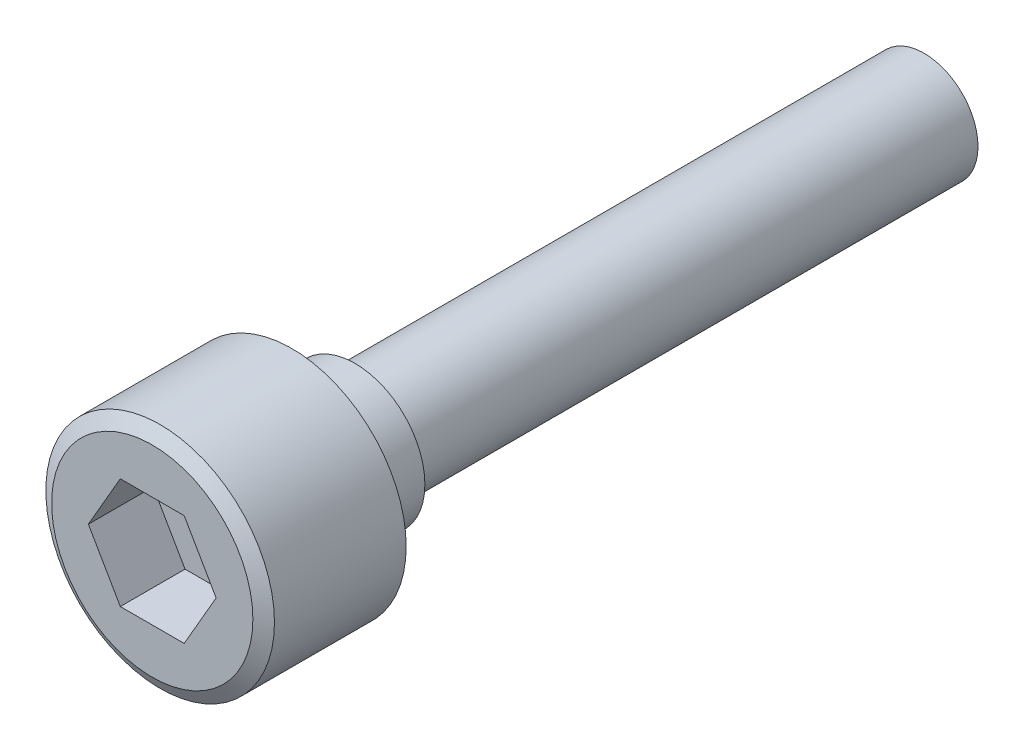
ISO-10303-21;
HEADER;
FILE_DESCRIPTION(('STEP AP214'),'2;1');
FILE_NAME('part.step','',(''),(''),'','','');
FILE_SCHEMA(('AUTOMOTIVE_DESIGN { 1 0 10303 214 1 1 1 1 }'));
ENDSEC;
DATA;
#1=APPLICATION_CONTEXT('core data for automotive mechanical design processes');
#2=APPLICATION_PROTOCOL_DEFINITION('international standard','automotive_design',2000,#1);
#3=PRODUCT_CONTEXT('',#1,'mechanical');
#4=PRODUCT('Part','Part','',(#3));
#5=PRODUCT_RELATED_PRODUCT_CATEGORY('part','',(#4));
#6=PRODUCT_DEFINITION_FORMATION('','',#4);
#7=PRODUCT_DEFINITION_CONTEXT('part definition',#1,'design');
#8=PRODUCT_DEFINITION('design','',#6,#7);
#9=PRODUCT_DEFINITION_SHAPE('','',#8);
#10=(LENGTH_UNIT() NAMED_UNIT(*) SI_UNIT(.MILLI.,.METRE.));
#11=(NAMED_UNIT(*) PLANE_ANGLE_UNIT() SI_UNIT($,.RADIAN.));
#12=(NAMED_UNIT(*) SI_UNIT($,.STERADIAN.) SOLID_ANGLE_UNIT());
#13=UNCERTAINTY_MEASURE_WITH_UNIT(LENGTH_MEASURE(1.E-05),#10,'distance_accuracy_value','');
#14=(GEOMETRIC_REPRESENTATION_CONTEXT(3) GLOBAL_UNCERTAINTY_ASSIGNED_CONTEXT((#13)) GLOBAL_UNIT_ASSIGNED_CONTEXT((#10,
#11,#12)) REPRESENTATION_CONTEXT('',''));
#15=CARTESIAN_POINT('',(0.,0.,0.));
#16=DIRECTION('',(0.,0.,1.));
#17=DIRECTION('',(1.,0.,0.));
#18=AXIS2_PLACEMENT_3D('',#15,#16,#17);
#19=CARTESIAN_POINT('',(0.,1.38906250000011,0.));
#20=DIRECTION('',(0.,0.,1.));
#21=DIRECTION('',(1.,0.,0.));
#22=AXIS2_PLACEMENT_3D('',#19,#20,#21);
#23=PLANE('',#22);
#24=CARTESIAN_POINT('',(0.,0.,0.));
#25=DIRECTION('',(0.,0.,1.));
#26=DIRECTION('',(1.,0.,0.));
#27=AXIS2_PLACEMENT_3D('',#24,#25,#26);
#28=CIRCLE('',#27,2.52649616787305);
#29=CARTESIAN_POINT('',(2.52649616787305,0.,0.));
#30=VERTEX_POINT('',#29);
#31=EDGE_CURVE('E130',#30,#30,#28,.T.);
#32=ORIENTED_EDGE('',*,*,#31,.T.);
#33=EDGE_LOOP('',(#32));
#34=FACE_BOUND('',#33,.T.);
#35=DIRECTION('',(1.,0.,0.));
#36=VECTOR('',#35,1.);
#37=CARTESIAN_POINT('',(4.71844785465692E-13,-1.38906249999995,0.));
#38=LINE('',#37,#36);
#39=CARTESIAN_POINT('',(-0.80197560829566,-1.38906249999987,0.));
#40=VERTEX_POINT('',#39);
#41=CARTESIAN_POINT('',(0.801975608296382,-1.38906249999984,0.));
#42=VERTEX_POINT('',#41);
#43=EDGE_CURVE('E169',#40,#42,#38,.T.);
#44=ORIENTED_EDGE('',*,*,#43,.F.);
#45=DIRECTION('',(-0.499999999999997,0.866025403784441,0.));
#46=VECTOR('',#45,1.);
#47=CARTESIAN_POINT('',(-1.8044451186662,0.347265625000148,0.));
#48=LINE('',#47,#46);
#49=CARTESIAN_POINT('',(-1.60395121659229,1.38777878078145E-13,0.));
#50=VERTEX_POINT('',#49);
#51=EDGE_CURVE('E11',#40,#50,#48,.T.);
#52=ORIENTED_EDGE('',*,*,#51,.T.);
#53=DIRECTION('',(-0.499999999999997,-0.866025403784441,0.));
#54=VECTOR('',#53,1.);
#55=CARTESIAN_POINT('',(-0.60148170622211,1.73632812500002,0.));
#56=LINE('',#55,#54);
#57=CARTESIAN_POINT('',(-0.801975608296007,1.38906250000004,0.));
#58=VERTEX_POINT('',#57);
#59=EDGE_CURVE('E52',#58,#50,#56,.T.);
#60=ORIENTED_EDGE('',*,*,#59,.F.);
#61=DIRECTION('',(1.,0.,0.));
#62=VECTOR('',#61,1.);
#63=CARTESIAN_POINT('',(0.,1.38906250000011,0.));
#64=LINE('',#63,#62);
#65=CARTESIAN_POINT('',(0.801975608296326,1.38906250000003,0.));
#66=VERTEX_POINT('',#65);
#67=EDGE_CURVE('E110',#58,#66,#64,.T.);
#68=ORIENTED_EDGE('',*,*,#67,.T.);
#69=DIRECTION('',(0.499999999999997,-0.866025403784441,0.));
#70=VECTOR('',#69,1.);
#71=CARTESIAN_POINT('',(0.601481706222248,1.7363281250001,0.));
#72=LINE('',#71,#70);
#73=CARTESIAN_POINT('',(1.60395121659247,0.,0.));
#74=VERTEX_POINT('',#73);
#75=EDGE_CURVE('E163',#66,#74,#72,.T.);
#76=ORIENTED_EDGE('',*,*,#75,.T.);
#77=DIRECTION('',(0.499999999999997,0.866025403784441,0.));
#78=VECTOR('',#77,1.);
#79=CARTESIAN_POINT('',(1.80444511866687,0.347265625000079,0.));
#80=LINE('',#79,#78);
#81=EDGE_CURVE('E159',#42,#74,#80,.T.);
#82=ORIENTED_EDGE('',*,*,#81,.F.);
#83=EDGE_LOOP('',(#44,#52,#60,#68,#76,#82));
#84=FACE_BOUND('',#83,.T.);
#85=ADVANCED_FACE('F42',(#34,#84),#23,.T.);
#86=CARTESIAN_POINT('',(0.,0.,0.));
#87=DIRECTION('',(0.,0.,-1.));
#88=DIRECTION('',(-1.,0.,0.));
#89=AXIS2_PLACEMENT_3D('',#86,#87,#88);
#90=CONICAL_SURFACE('',#89,2.52649616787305,1.0471975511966);
#91=CARTESIAN_POINT('',(0.,0.,-0.198437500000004));
#92=DIRECTION('',(0.,0.,1.));
#93=DIRECTION('',(1.,0.,0.));
#94=AXIS2_PLACEMENT_3D('',#91,#92,#93);
#95=CIRCLE('',#94,2.8702);
#96=CARTESIAN_POINT('',(2.8702,0.,-0.198437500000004));
#97=VERTEX_POINT('',#96);
#98=EDGE_CURVE('E155',#97,#97,#95,.T.);
#99=ORIENTED_EDGE('',*,*,#98,.T.);
#100=EDGE_LOOP('',(#99));
#101=FACE_BOUND('',#100,.T.);
#102=ORIENTED_EDGE('',*,*,#31,.F.);
#103=EDGE_LOOP('',(#102));
#104=FACE_BOUND('',#103,.T.);
#105=ADVANCED_FACE('F44',(#101,#104),#90,.T.);
#106=CARTESIAN_POINT('',(0.,0.,0.));
#107=DIRECTION('',(0.,0.,1.));
#108=DIRECTION('',(1.,0.,0.));
#109=AXIS2_PLACEMENT_3D('',#106,#107,#108);
#110=CYLINDRICAL_SURFACE('',#109,2.8702);
#111=CARTESIAN_POINT('',(0.,0.,-3.5052));
#112=DIRECTION('',(0.,0.,1.));
#113=DIRECTION('',(1.,0.,0.));
#114=AXIS2_PLACEMENT_3D('',#111,#112,#113);
#115=CIRCLE('',#114,2.8702);
#116=CARTESIAN_POINT('',(2.8702,0.,-3.5052));
#117=VERTEX_POINT('',#116);
#118=EDGE_CURVE('E151',#117,#117,#115,.T.);
#119=ORIENTED_EDGE('',*,*,#118,.T.);
#120=EDGE_LOOP('',(#119));
#121=FACE_BOUND('',#120,.T.);
#122=ORIENTED_EDGE('',*,*,#98,.F.);
#123=EDGE_LOOP('',(#122));
#124=FACE_BOUND('',#123,.T.);
#125=ADVANCED_FACE('F227',(#121,#124),#110,.T.);
#126=CARTESIAN_POINT('',(3.60822483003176E-13,2.8702000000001,-3.5052));
#127=DIRECTION('',(0.,0.,-1.));
#128=DIRECTION('',(-1.,0.,0.));
#129=AXIS2_PLACEMENT_3D('',#126,#127,#128);
#130=PLANE('',#129);
#131=CARTESIAN_POINT('',(0.,0.,-3.5052));
#132=DIRECTION('',(0.,0.,1.));
#133=DIRECTION('',(1.,0.,0.));
#134=AXIS2_PLACEMENT_3D('',#131,#132,#133);
#135=CIRCLE('',#134,1.7526);
#136=CARTESIAN_POINT('',(1.7526,0.,-3.5052));
#137=VERTEX_POINT('',#136);
#138=EDGE_CURVE('E147',#137,#137,#135,.T.);
#139=ORIENTED_EDGE('',*,*,#138,.T.);
#140=EDGE_LOOP('',(#139));
#141=FACE_BOUND('',#140,.T.);
#142=ORIENTED_EDGE('',*,*,#118,.F.);
#143=EDGE_LOOP('',(#142));
#144=FACE_BOUND('',#143,.T.);
#145=ADVANCED_FACE('F247',(#141,#144),#130,.T.);
#146=CARTESIAN_POINT('',(0.,0.,0.));
#147=DIRECTION('',(0.,0.,1.));
#148=DIRECTION('',(1.,0.,0.));
#149=AXIS2_PLACEMENT_3D('',#146,#147,#148);
#150=CYLINDRICAL_SURFACE('',#149,1.7526);
#151=CARTESIAN_POINT('',(0.,0.,-5.09269999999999));
#152=DIRECTION('',(0.,0.,1.));
#153=DIRECTION('',(1.,0.,0.));
#154=AXIS2_PLACEMENT_3D('',#151,#152,#153);
#155=CIRCLE('',#154,1.7526);
#156=CARTESIAN_POINT('',(1.7526,0.,-5.09269999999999));
#157=VERTEX_POINT('',#156);
#158=EDGE_CURVE('E143',#157,#157,#155,.T.);
#159=ORIENTED_EDGE('',*,*,#158,.T.);
#160=EDGE_LOOP('',(#159));
#161=FACE_BOUND('',#160,.T.);
#162=ORIENTED_EDGE('',*,*,#138,.F.);
#163=EDGE_LOOP('',(#162));
#164=FACE_BOUND('',#163,.T.);
#165=ADVANCED_FACE('F243',(#161,#164),#150,.T.);
#166=CARTESIAN_POINT('',(0.,1.75260000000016,-5.09269999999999));
#167=DIRECTION('',(0.,0.,-1.));
#168=DIRECTION('',(-1.,0.,0.));
#169=AXIS2_PLACEMENT_3D('',#166,#167,#168);
#170=PLANE('',#169);
#171=CARTESIAN_POINT('',(0.,0.,-5.09269999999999));
#172=DIRECTION('',(0.,0.,1.));
#173=DIRECTION('',(1.,0.,0.));
#174=AXIS2_PLACEMENT_3D('',#171,#172,#173);
#175=CIRCLE('',#174,1.35255);
#176=CARTESIAN_POINT('',(1.35255,0.,-5.09269999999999));
#177=VERTEX_POINT('',#176);
#178=EDGE_CURVE('E139',#177,#177,#175,.T.);
#179=ORIENTED_EDGE('',*,*,#178,.T.);
#180=EDGE_LOOP('',(#179));
#181=FACE_BOUND('',#180,.T.);
#182=ORIENTED_EDGE('',*,*,#158,.F.);
#183=EDGE_LOOP('',(#182));
#184=FACE_BOUND('',#183,.T.);
#185=ADVANCED_FACE('F239',(#181,#184),#170,.T.);
#186=CARTESIAN_POINT('',(0.,0.,0.));
#187=DIRECTION('',(0.,0.,1.));
#188=DIRECTION('',(1.,0.,0.));
#189=AXIS2_PLACEMENT_3D('',#186,#187,#188);
#190=CYLINDRICAL_SURFACE('',#189,1.35255);
#191=CARTESIAN_POINT('',(0.,0.,-19.3802));
#192=DIRECTION('',(0.,0.,1.));
#193=DIRECTION('',(1.,0.,0.));
#194=AXIS2_PLACEMENT_3D('',#191,#192,#193);
#195=CIRCLE('',#194,1.35255);
#196=CARTESIAN_POINT('',(1.35255,0.,-19.3802));
#197=VERTEX_POINT('',#196);
#198=EDGE_CURVE('E135',#197,#197,#195,.T.);
#199=ORIENTED_EDGE('',*,*,#198,.T.);
#200=EDGE_LOOP('',(#199));
#201=FACE_BOUND('',#200,.T.);
#202=ORIENTED_EDGE('',*,*,#178,.F.);
#203=EDGE_LOOP('',(#202));
#204=FACE_BOUND('',#203,.T.);
#205=ADVANCED_FACE('F235',(#201,#204),#190,.T.);
#206=CARTESIAN_POINT('',(1.38777878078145E-13,1.35255000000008,-19.3802));
#207=DIRECTION('',(0.,0.,-1.));
#208=DIRECTION('',(-1.,0.,0.));
#209=AXIS2_PLACEMENT_3D('',#206,#207,#208);
#210=PLANE('',#209);
#211=ORIENTED_EDGE('',*,*,#198,.F.);
#212=EDGE_LOOP('',(#211));
#213=FACE_BOUND('',#212,.T.);
#214=ADVANCED_FACE('F219',(#213),#210,.T.);
#215=CARTESIAN_POINT('',(-0.80197560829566,-1.38906249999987,-5.86925603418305));
#216=DIRECTION('',(0.,-1.,0.));
#217=DIRECTION('',(0.,0.,-1.));
#218=AXIS2_PLACEMENT_3D('',#215,#216,#217);
#219=PLANE('',#218);
#220=ORIENTED_EDGE('',*,*,#43,.T.);
#221=DIRECTION('',(0.,0.,1.));
#222=VECTOR('',#221,1.);
#223=CARTESIAN_POINT('',(0.801975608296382,-1.38906249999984,-5.86925603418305));
#224=LINE('',#223,#222);
#225=CARTESIAN_POINT('',(0.801975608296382,-1.38906249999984,-1.6256));
#226=VERTEX_POINT('',#225);
#227=EDGE_CURVE('E125',#226,#42,#224,.T.);
#228=ORIENTED_EDGE('',*,*,#227,.F.);
#229=DIRECTION('',(-1.,0.,0.));
#230=VECTOR('',#229,1.);
#231=CARTESIAN_POINT('',(-0.80197560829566,-1.38906249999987,-1.6256));
#232=LINE('',#231,#230);
#233=CARTESIAN_POINT('',(-0.80197560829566,-1.38906249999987,-1.6256));
#234=VERTEX_POINT('',#233);
#235=EDGE_CURVE('E131',#226,#234,#232,.T.);
#236=ORIENTED_EDGE('',*,*,#235,.T.);
#237=DIRECTION('',(0.,0.,1.));
#238=VECTOR('',#237,1.);
#239=CARTESIAN_POINT('',(-0.80197560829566,-1.38906249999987,-5.86925603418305));
#240=LINE('',#239,#238);
#241=EDGE_CURVE('E116',#234,#40,#240,.T.);
#242=ORIENTED_EDGE('',*,*,#241,.T.);
#243=EDGE_LOOP('',(#220,#228,#236,#242));
#244=FACE_BOUND('',#243,.T.);
#245=ADVANCED_FACE('F178',(#244),#219,.F.);
#246=CARTESIAN_POINT('',(-0.80197560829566,-1.38906249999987,-5.86925603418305));
#247=DIRECTION('',(0.866025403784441,0.499999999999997,0.));
#248=DIRECTION('',(-0.499999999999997,0.866025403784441,0.));
#249=AXIS2_PLACEMENT_3D('',#246,#247,#248);
#250=PLANE('',#249);
#251=ORIENTED_EDGE('',*,*,#51,.F.);
#252=ORIENTED_EDGE('',*,*,#241,.F.);
#253=DIRECTION('',(0.499999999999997,-0.866025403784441,0.));
#254=VECTOR('',#253,1.);
#255=CARTESIAN_POINT('',(-0.80197560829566,-1.38906249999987,-1.6256));
#256=LINE('',#255,#254);
#257=CARTESIAN_POINT('',(-1.60395121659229,1.38777878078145E-13,-1.6256));
#258=VERTEX_POINT('',#257);
#259=EDGE_CURVE('E95',#258,#234,#256,.T.);
#260=ORIENTED_EDGE('',*,*,#259,.F.);
#261=DIRECTION('',(0.,0.,1.));
#262=VECTOR('',#261,1.);
#263=CARTESIAN_POINT('',(-1.60395121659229,1.38777878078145E-13,-5.86925603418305));
#264=LINE('',#263,#262);
#265=EDGE_CURVE('E91',#258,#50,#264,.T.);
#266=ORIENTED_EDGE('',*,*,#265,.T.);
#267=EDGE_LOOP('',(#251,#252,#260,#266));
#268=FACE_BOUND('',#267,.T.);
#269=ADVANCED_FACE('F211',(#268),#250,.T.);
#270=CARTESIAN_POINT('',(-0.801975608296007,1.38906250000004,-5.86925603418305));
#271=DIRECTION('',(-0.866025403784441,0.499999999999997,0.));
#272=DIRECTION('',(-0.499999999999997,-0.866025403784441,0.));
#273=AXIS2_PLACEMENT_3D('',#270,#271,#272);
#274=PLANE('',#273);
#275=ORIENTED_EDGE('',*,*,#59,.T.);
#276=ORIENTED_EDGE('',*,*,#265,.F.);
#277=DIRECTION('',(0.499999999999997,0.866025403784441,0.));
#278=VECTOR('',#277,1.);
#279=CARTESIAN_POINT('',(-0.801975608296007,1.38906250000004,-1.6256));
#280=LINE('',#279,#278);
#281=CARTESIAN_POINT('',(-0.801975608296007,1.38906250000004,-1.6256));
#282=VERTEX_POINT('',#281);
#283=EDGE_CURVE('E83',#258,#282,#280,.T.);
#284=ORIENTED_EDGE('',*,*,#283,.T.);
#285=DIRECTION('',(0.,0.,1.));
#286=VECTOR('',#285,1.);
#287=CARTESIAN_POINT('',(-0.801975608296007,1.38906250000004,-5.86925603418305));
#288=LINE('',#287,#286);
#289=EDGE_CURVE('E89',#282,#58,#288,.T.);
#290=ORIENTED_EDGE('',*,*,#289,.T.);
#291=EDGE_LOOP('',(#275,#276,#284,#290));
#292=FACE_BOUND('',#291,.T.);
#293=ADVANCED_FACE('F86',(#292),#274,.F.);
#294=CARTESIAN_POINT('',(-0.801975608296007,1.38906250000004,-5.86925603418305));
#295=DIRECTION('',(0.,-1.,0.));
#296=DIRECTION('',(0.,0.,-1.));
#297=AXIS2_PLACEMENT_3D('',#294,#295,#296);
#298=PLANE('',#297);
#299=ORIENTED_EDGE('',*,*,#67,.F.);
#300=ORIENTED_EDGE('',*,*,#289,.F.);
#301=DIRECTION('',(-1.,0.,0.));
#302=VECTOR('',#301,1.);
#303=CARTESIAN_POINT('',(-0.801975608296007,1.38906250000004,-1.6256));
#304=LINE('',#303,#302);
#305=CARTESIAN_POINT('',(0.801975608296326,1.38906250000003,-1.6256));
#306=VERTEX_POINT('',#305);
#307=EDGE_CURVE('E96',#306,#282,#304,.T.);
#308=ORIENTED_EDGE('',*,*,#307,.F.);
#309=DIRECTION('',(0.,0.,1.));
#310=VECTOR('',#309,1.);
#311=CARTESIAN_POINT('',(0.801975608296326,1.38906250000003,-5.86925603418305));
#312=LINE('',#311,#310);
#313=EDGE_CURVE('E112',#306,#66,#312,.T.);
#314=ORIENTED_EDGE('',*,*,#313,.T.);
#315=EDGE_LOOP('',(#299,#300,#308,#314));
#316=FACE_BOUND('',#315,.T.);
#317=ADVANCED_FACE('F108',(#316),#298,.T.);
#318=CARTESIAN_POINT('',(0.801975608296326,1.38906250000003,-5.86925603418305));
#319=DIRECTION('',(-0.866025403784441,-0.499999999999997,0.));
#320=DIRECTION('',(0.499999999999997,-0.866025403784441,0.));
#321=AXIS2_PLACEMENT_3D('',#318,#319,#320);
#322=PLANE('',#321);
#323=ORIENTED_EDGE('',*,*,#75,.F.);
#324=ORIENTED_EDGE('',*,*,#313,.F.);
#325=DIRECTION('',(-0.499999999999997,0.866025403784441,0.));
#326=VECTOR('',#325,1.);
#327=CARTESIAN_POINT('',(0.801975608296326,1.38906250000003,-1.6256));
#328=LINE('',#327,#326);
#329=CARTESIAN_POINT('',(1.60395121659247,0.,-1.6256));
#330=VERTEX_POINT('',#329);
#331=EDGE_CURVE('E101',#330,#306,#328,.T.);
#332=ORIENTED_EDGE('',*,*,#331,.F.);
#333=DIRECTION('',(0.,0.,1.));
#334=VECTOR('',#333,1.);
#335=CARTESIAN_POINT('',(1.60395121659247,0.,-5.86925603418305));
#336=LINE('',#335,#334);
#337=EDGE_CURVE('E118',#330,#74,#336,.T.);
#338=ORIENTED_EDGE('',*,*,#337,.T.);
#339=EDGE_LOOP('',(#323,#324,#332,#338));
#340=FACE_BOUND('',#339,.T.);
#341=ADVANCED_FACE('F193',(#340),#322,.T.);
#342=CARTESIAN_POINT('',(0.801975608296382,-1.38906249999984,-5.86925603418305));
#343=DIRECTION('',(0.866025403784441,-0.499999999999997,0.));
#344=DIRECTION('',(0.499999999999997,0.866025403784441,0.));
#345=AXIS2_PLACEMENT_3D('',#342,#343,#344);
#346=PLANE('',#345);
#347=ORIENTED_EDGE('',*,*,#81,.T.);
#348=ORIENTED_EDGE('',*,*,#337,.F.);
#349=DIRECTION('',(-0.499999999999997,-0.866025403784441,0.));
#350=VECTOR('',#349,1.);
#351=CARTESIAN_POINT('',(0.801975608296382,-1.38906249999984,-1.6256));
#352=LINE('',#351,#350);
#353=EDGE_CURVE('E62',#330,#226,#352,.T.);
#354=ORIENTED_EDGE('',*,*,#353,.T.);
#355=ORIENTED_EDGE('',*,*,#227,.T.);
#356=EDGE_LOOP('',(#347,#348,#354,#355));
#357=FACE_BOUND('',#356,.T.);
#358=ADVANCED_FACE('F187',(#357),#346,.F.);
#359=CARTESIAN_POINT('',(0.,1.38906250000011,-1.6256));
#360=DIRECTION('',(0.,0.,-1.));
#361=DIRECTION('',(-1.,0.,0.));
#362=AXIS2_PLACEMENT_3D('',#359,#360,#361);
#363=PLANE('',#362);
#364=ORIENTED_EDGE('',*,*,#331,.T.);
#365=ORIENTED_EDGE('',*,*,#307,.T.);
#366=ORIENTED_EDGE('',*,*,#283,.F.);
#367=ORIENTED_EDGE('',*,*,#259,.T.);
#368=ORIENTED_EDGE('',*,*,#235,.F.);
#369=ORIENTED_EDGE('',*,*,#353,.F.);
#370=EDGE_LOOP('',(#364,#365,#366,#367,#368,#369));
#371=FACE_BOUND('',#370,.T.);
#372=ADVANCED_FACE('F99',(#371),#363,.F.);
#373=CLOSED_SHELL('',(#85,#105,#125,#145,#165,#185,#205,#214,#245,#269,#293,#317,#341,#358,#372));
#374=MANIFOLD_SOLID_BREP('B2',#373);
#375=ADVANCED_BREP_SHAPE_REPRESENTATION('',(#18,#374),#14);
#376=SHAPE_DEFINITION_REPRESENTATION(#9,#375);
ENDSEC;
END-ISO-10303-21;
